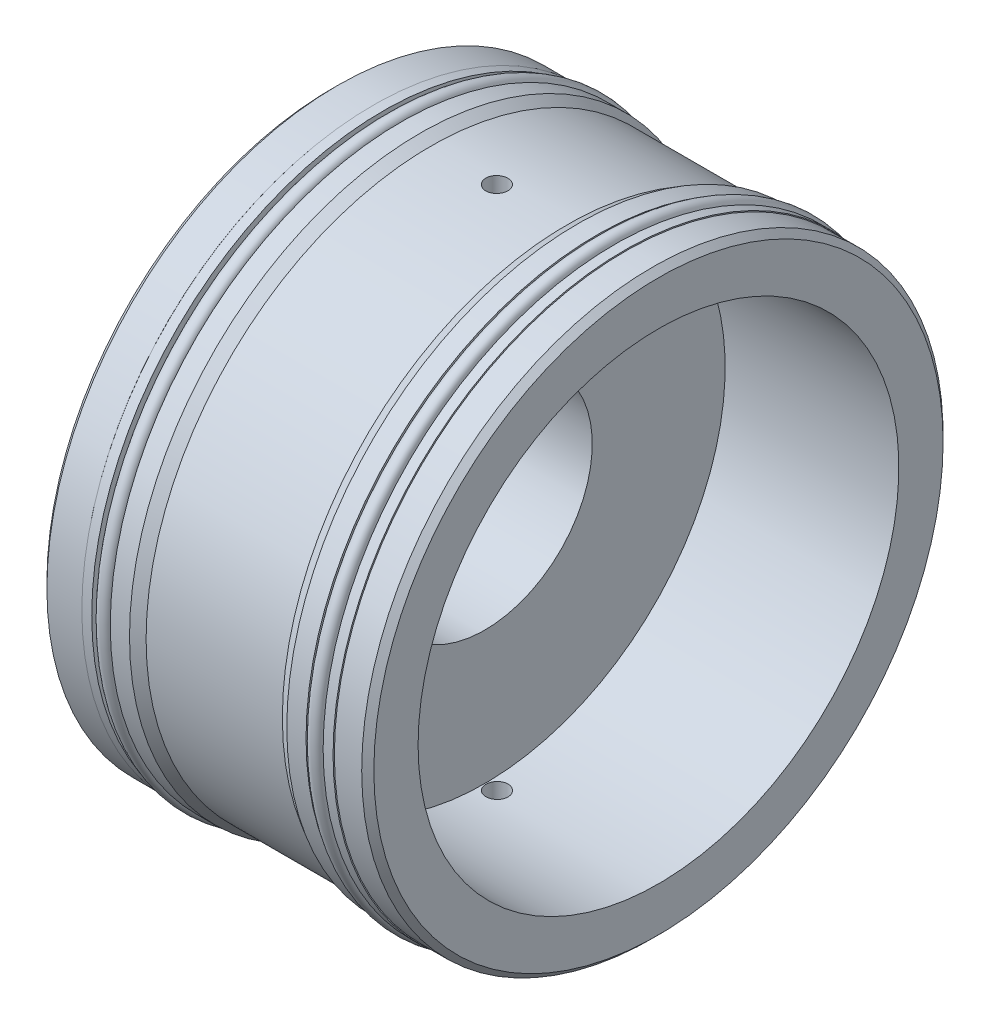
from build123d import *

# Parameters (mm, degrees)
CHAMFER1_SIZE           = 0.762
SKETCH6_R               = 0.889
SKETCH6_W               = 1.2446
SKETCH6_H               = 1.3462
CUT_EXTRUDE1_DEPTH      = 57.095373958
CUT_EXTRUDE1_DEPTH_BACK = 57.095373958
SKETCH7_R               = 1.3843


with BuildPart() as part:
    # Sketch1 → Revolve1 (revolve)
    with BuildSketch(Plane.XY, mode=Mode.PRIVATE) as revolve1_sk:
        Polygon((-20.5105, 13.4874), (-20.5105, 36.4744), (-15.3543, 36.4744), (-15.3543, 35.2171), (-11.7983, 35.2171), (-11.7983, 36.4744), (-9.3853, 36.4744), (-9.3853, 35.7124), (10.3505, 35.7124), (10.3505, 36.4744), (12.7635, 36.4744), (12.7635, 35.2171), (16.3195, 35.2171), (16.3195, 36.4744), (20.5105, 36.4744), (20.5105, 30.1625), (-1.2827, 30.1625), (-1.2827, 13.4874), align=None)
    revolve(revolve1_sk.sketch.rotate(Axis((0, 0, 0), (1, 0, 0)), 90), axis=Axis((0, 0, 0), (1, 0, 0)))

    # Chamfer1
    chamfer1_edges = [part.edges().sort_by_distance(p)[0] for p in [
        (-20.5105, 0, -36.4744),
        (20.5105, 0, -36.4744),
    ]]
    chamfer(chamfer1_edges, length=CHAMFER1_SIZE)

    # Sketch6 → Revolve3 (revolve)
    with BuildSketch(Plane.XY, mode=Mode.PRIVATE) as revolve3_sk:
        with Locations((-12.7635, 36.0299)):
            Circle(SKETCH6_R)
        with Locations((13.7287, 36.0299)):
            Circle(SKETCH6_R)
        with Locations((-14.6558, 35.8902)):
            Rectangle(SKETCH6_W, SKETCH6_H)
        with Locations((15.621, 35.8902)):
            Rectangle(SKETCH6_W, SKETCH6_H)
    revolve(revolve3_sk.sketch.rotate(Axis((0, 0, 0), (1, 0, 0)), 90), axis=Axis((0, 0, 0), (1, 0, 0)))

    # Sketch7 → Cut-Extrude1 (cut, two sides: drawn at the far end of the back side and taken through both)
    with BuildSketch(Plane(origin=(0, 0, 0), x_dir=(0, 0, -1), z_dir=(0, 1, 0)).offset(-CUT_EXTRUDE1_DEPTH_BACK)):
        with Locations(Location((0, -0.2413, 0), (0, 0, 180))):
            Circle(SKETCH7_R)
    extrude(amount=CUT_EXTRUDE1_DEPTH + CUT_EXTRUDE1_DEPTH_BACK, mode=Mode.SUBTRACT)

    # Sketch8 → Revolve4 (revolve)
    with BuildSketch(Plane.XY, mode=Mode.PRIVATE) as revolve4_sk:
        Polygon((-9.3853, 36.4744), (-9.3853, 35.7124), (-8.065477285, 35.7124), align=None)
        Polygon((9.030677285, 35.7124), (10.3505, 36.4744), (10.3505, 35.7124), align=None)
    revolve(revolve4_sk.sketch.rotate(Axis((0, 0, 0), (1, 0, 0)), 90), axis=Axis((0, 0, 0), (1, 0, 0)))


solid = part.part
